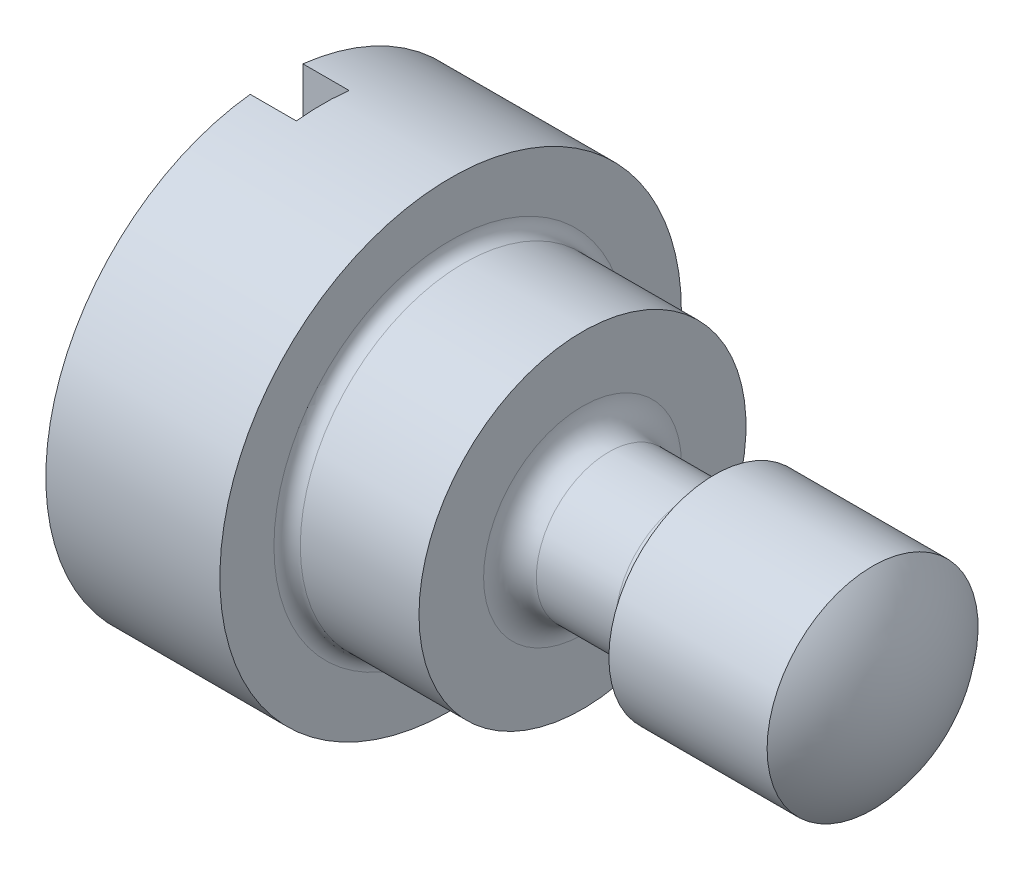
ISO-10303-21;
HEADER;
FILE_DESCRIPTION(('STEP AP214'),'2;1');
FILE_NAME('part.step','',(''),(''),'','','');
FILE_SCHEMA(('AUTOMOTIVE_DESIGN { 1 0 10303 214 1 1 1 1 }'));
ENDSEC;
DATA;
#1=APPLICATION_CONTEXT('core data for automotive mechanical design processes');
#2=APPLICATION_PROTOCOL_DEFINITION('international standard','automotive_design',2000,#1);
#3=PRODUCT_CONTEXT('',#1,'mechanical');
#4=PRODUCT('Part','Part','',(#3));
#5=PRODUCT_RELATED_PRODUCT_CATEGORY('part','',(#4));
#6=PRODUCT_DEFINITION_FORMATION('','',#4);
#7=PRODUCT_DEFINITION_CONTEXT('part definition',#1,'design');
#8=PRODUCT_DEFINITION('design','',#6,#7);
#9=PRODUCT_DEFINITION_SHAPE('','',#8);
#10=(LENGTH_UNIT() NAMED_UNIT(*) SI_UNIT(.MILLI.,.METRE.));
#11=(NAMED_UNIT(*) PLANE_ANGLE_UNIT() SI_UNIT($,.RADIAN.));
#12=(NAMED_UNIT(*) SI_UNIT($,.STERADIAN.) SOLID_ANGLE_UNIT());
#13=UNCERTAINTY_MEASURE_WITH_UNIT(LENGTH_MEASURE(1.E-05),#10,'distance_accuracy_value','');
#14=(GEOMETRIC_REPRESENTATION_CONTEXT(3) GLOBAL_UNCERTAINTY_ASSIGNED_CONTEXT((#13)) GLOBAL_UNIT_ASSIGNED_CONTEXT((#10,
#11,#12)) REPRESENTATION_CONTEXT('',''));
#15=CARTESIAN_POINT('',(0.,0.,0.));
#16=DIRECTION('',(0.,0.,1.));
#17=DIRECTION('',(1.,0.,0.));
#18=AXIS2_PLACEMENT_3D('',#15,#16,#17);
#19=CARTESIAN_POINT('',(1.32,0.,0.));
#20=DIRECTION('',(1.,0.,0.));
#21=DIRECTION('',(0.,0.,-1.));
#22=AXIS2_PLACEMENT_3D('',#19,#20,#21);
#23=PLANE('',#22);
#24=CARTESIAN_POINT('',(1.32,0.,0.));
#25=DIRECTION('',(1.,0.,0.));
#26=DIRECTION('',(0.,0.,-1.));
#27=AXIS2_PLACEMENT_3D('',#24,#25,#26);
#28=CIRCLE('',#27,1.34);
#29=CARTESIAN_POINT('',(1.32,0.,-1.34));
#30=VERTEX_POINT('',#29);
#31=EDGE_CURVE('E54',#30,#30,#28,.F.);
#32=ORIENTED_EDGE('',*,*,#31,.T.);
#33=EDGE_LOOP('',(#32));
#34=FACE_BOUND('',#33,.T.);
#35=CARTESIAN_POINT('',(1.32,0.,0.));
#36=DIRECTION('',(1.,0.,0.));
#37=DIRECTION('',(0.,0.,-1.));
#38=AXIS2_PLACEMENT_3D('',#35,#36,#37);
#39=CIRCLE('',#38,1.75);
#40=CARTESIAN_POINT('',(1.32,0.,-1.75));
#41=VERTEX_POINT('',#40);
#42=EDGE_CURVE('E116',#41,#41,#39,.T.);
#43=ORIENTED_EDGE('',*,*,#42,.T.);
#44=EDGE_LOOP('',(#43));
#45=FACE_BOUND('',#44,.T.);
#46=ADVANCED_FACE('F50',(#34,#45),#23,.T.);
#47=CARTESIAN_POINT('',(0.,0.,0.));
#48=DIRECTION('',(1.,0.,0.));
#49=DIRECTION('',(0.,0.,-1.));
#50=AXIS2_PLACEMENT_3D('',#47,#48,#49);
#51=PLANE('',#50);
#52=CARTESIAN_POINT('',(0.,0.,0.));
#53=DIRECTION('',(1.,0.,0.));
#54=DIRECTION('',(0.,0.,-1.));
#55=AXIS2_PLACEMENT_3D('',#52,#53,#54);
#56=CIRCLE('',#55,1.75);
#57=CARTESIAN_POINT('',(0.,-1.73853386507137,-0.2));
#58=VERTEX_POINT('',#57);
#59=CARTESIAN_POINT('',(0.,1.73853386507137,-0.2));
#60=VERTEX_POINT('',#59);
#61=EDGE_CURVE('E114',#58,#60,#56,.T.);
#62=ORIENTED_EDGE('',*,*,#61,.F.);
#63=DIRECTION('',(0.,1.,0.));
#64=VECTOR('',#63,1.);
#65=CARTESIAN_POINT('',(0.,0.,-0.2));
#66=LINE('',#65,#64);
#67=EDGE_CURVE('E125',#58,#60,#66,.T.);
#68=ORIENTED_EDGE('',*,*,#67,.T.);
#69=EDGE_LOOP('',(#62,#68));
#70=FACE_BOUND('',#69,.T.);
#71=ADVANCED_FACE('F142',(#70),#51,.F.);
#72=CARTESIAN_POINT('',(1.32,0.,0.));
#73=DIRECTION('',(-1.,0.,0.));
#74=DIRECTION('',(0.,0.,1.));
#75=AXIS2_PLACEMENT_3D('',#72,#73,#74);
#76=CYLINDRICAL_SURFACE('',#75,1.75);
#77=ORIENTED_EDGE('',*,*,#42,.F.);
#78=EDGE_LOOP('',(#77));
#79=FACE_BOUND('',#78,.T.);
#80=ORIENTED_EDGE('',*,*,#61,.T.);
#81=DIRECTION('',(-1.,0.,0.));
#82=VECTOR('',#81,1.);
#83=CARTESIAN_POINT('',(1.32,1.73853386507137,-0.2));
#84=LINE('',#83,#82);
#85=CARTESIAN_POINT('',(0.35,1.73853386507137,-0.2));
#86=VERTEX_POINT('',#85);
#87=EDGE_CURVE('E110',#60,#86,#84,.F.);
#88=ORIENTED_EDGE('',*,*,#87,.T.);
#89=CARTESIAN_POINT('',(0.35,0.,0.));
#90=DIRECTION('',(1.,0.,0.));
#91=DIRECTION('',(0.,0.,-1.));
#92=AXIS2_PLACEMENT_3D('',#89,#90,#91);
#93=CIRCLE('',#92,1.75);
#94=CARTESIAN_POINT('',(0.35,1.73853386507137,0.2));
#95=VERTEX_POINT('',#94);
#96=EDGE_CURVE('E67',#86,#95,#93,.T.);
#97=ORIENTED_EDGE('',*,*,#96,.T.);
#98=DIRECTION('',(-1.,0.,0.));
#99=VECTOR('',#98,1.);
#100=CARTESIAN_POINT('',(1.32,1.73853386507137,0.2));
#101=LINE('',#100,#99);
#102=CARTESIAN_POINT('',(0.,1.73853386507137,0.2));
#103=VERTEX_POINT('',#102);
#104=EDGE_CURVE('E96',#95,#103,#101,.T.);
#105=ORIENTED_EDGE('',*,*,#104,.T.);
#106=CARTESIAN_POINT('',(0.,-1.73853386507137,0.2));
#107=VERTEX_POINT('',#106);
#108=EDGE_CURVE('E102',#103,#107,#56,.T.);
#109=ORIENTED_EDGE('',*,*,#108,.T.);
#110=DIRECTION('',(-1.,0.,0.));
#111=VECTOR('',#110,1.);
#112=CARTESIAN_POINT('',(1.32,-1.73853386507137,0.2));
#113=LINE('',#112,#111);
#114=CARTESIAN_POINT('',(0.35,-1.73853386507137,0.2));
#115=VERTEX_POINT('',#114);
#116=EDGE_CURVE('E65',#107,#115,#113,.F.);
#117=ORIENTED_EDGE('',*,*,#116,.T.);
#118=CARTESIAN_POINT('',(0.35,-1.73853386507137,-0.2));
#119=VERTEX_POINT('',#118);
#120=EDGE_CURVE('E88',#115,#119,#93,.T.);
#121=ORIENTED_EDGE('',*,*,#120,.T.);
#122=DIRECTION('',(-1.,0.,0.));
#123=VECTOR('',#122,1.);
#124=CARTESIAN_POINT('',(1.32,-1.73853386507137,-0.2));
#125=LINE('',#124,#123);
#126=EDGE_CURVE('E113',#119,#58,#125,.T.);
#127=ORIENTED_EDGE('',*,*,#126,.T.);
#128=EDGE_LOOP('',(#80,#88,#97,#105,#109,#117,#121,#127));
#129=FACE_BOUND('',#128,.T.);
#130=ADVANCED_FACE('F101',(#79,#129),#76,.T.);
#131=ORIENTED_EDGE('',*,*,#108,.F.);
#132=DIRECTION('',(0.,-1.,0.));
#133=VECTOR('',#132,1.);
#134=CARTESIAN_POINT('',(0.,0.,0.2));
#135=LINE('',#134,#133);
#136=EDGE_CURVE('E118',#103,#107,#135,.T.);
#137=ORIENTED_EDGE('',*,*,#136,.T.);
#138=EDGE_LOOP('',(#131,#137));
#139=FACE_BOUND('',#138,.T.);
#140=ADVANCED_FACE('F146',(#139),#51,.F.);
#141=CARTESIAN_POINT('',(0.35,-1.75,-0.2));
#142=DIRECTION('',(1.,0.,0.));
#143=DIRECTION('',(0.,0.,-1.));
#144=AXIS2_PLACEMENT_3D('',#141,#142,#143);
#145=PLANE('',#144);
#146=DIRECTION('',(0.,1.,0.));
#147=VECTOR('',#146,1.);
#148=CARTESIAN_POINT('',(0.35,-1.75,-0.2));
#149=LINE('',#148,#147);
#150=EDGE_CURVE('E95',#119,#86,#149,.T.);
#151=ORIENTED_EDGE('',*,*,#150,.F.);
#152=ORIENTED_EDGE('',*,*,#120,.F.);
#153=DIRECTION('',(0.,1.,0.));
#154=VECTOR('',#153,1.);
#155=CARTESIAN_POINT('',(0.35,-1.75,0.2));
#156=LINE('',#155,#154);
#157=EDGE_CURVE('E93',#115,#95,#156,.T.);
#158=ORIENTED_EDGE('',*,*,#157,.T.);
#159=ORIENTED_EDGE('',*,*,#96,.F.);
#160=EDGE_LOOP('',(#151,#152,#158,#159));
#161=FACE_BOUND('',#160,.T.);
#162=ADVANCED_FACE('F87',(#161),#145,.F.);
#163=CARTESIAN_POINT('',(0.,-1.75,-0.2));
#164=DIRECTION('',(0.,0.,-1.));
#165=DIRECTION('',(-1.,0.,0.));
#166=AXIS2_PLACEMENT_3D('',#163,#164,#165);
#167=PLANE('',#166);
#168=ORIENTED_EDGE('',*,*,#150,.T.);
#169=ORIENTED_EDGE('',*,*,#87,.F.);
#170=ORIENTED_EDGE('',*,*,#67,.F.);
#171=ORIENTED_EDGE('',*,*,#126,.F.);
#172=EDGE_LOOP('',(#168,#169,#170,#171));
#173=FACE_BOUND('',#172,.T.);
#174=ADVANCED_FACE('F147',(#173),#167,.F.);
#175=CARTESIAN_POINT('',(0.,-1.75,0.2));
#176=DIRECTION('',(0.,0.,1.));
#177=DIRECTION('',(1.,0.,0.));
#178=AXIS2_PLACEMENT_3D('',#175,#176,#177);
#179=PLANE('',#178);
#180=ORIENTED_EDGE('',*,*,#157,.F.);
#181=ORIENTED_EDGE('',*,*,#116,.F.);
#182=ORIENTED_EDGE('',*,*,#136,.F.);
#183=ORIENTED_EDGE('',*,*,#104,.F.);
#184=EDGE_LOOP('',(#180,#181,#182,#183));
#185=FACE_BOUND('',#184,.T.);
#186=ADVANCED_FACE('F98',(#185),#179,.F.);
#187=CARTESIAN_POINT('',(3.60333333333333,0.,0.));
#188=DIRECTION('',(-1.,0.,0.));
#189=DIRECTION('',(0.,1.,0.));
#190=AXIS2_PLACEMENT_3D('',#187,#188,#189);
#191=SPHERICAL_SURFACE('',#190,1.21666666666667);
#192=CARTESIAN_POINT('',(4.52,0.,0.));
#193=DIRECTION('',(-1.,0.,0.));
#194=DIRECTION('',(0.,0.,1.));
#195=AXIS2_PLACEMENT_3D('',#192,#193,#194);
#196=CIRCLE('',#195,0.8);
#197=CARTESIAN_POINT('',(4.52,0.,0.8));
#198=VERTEX_POINT('',#197);
#199=EDGE_CURVE('E298',#198,#198,#196,.T.);
#200=ORIENTED_EDGE('',*,*,#199,.F.);
#201=EDGE_LOOP('',(#200));
#202=FACE_BOUND('',#201,.T.);
#203=ADVANCED_FACE('F189',(#202),#191,.T.);
#204=CARTESIAN_POINT('',(-0.659514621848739,0.,0.));
#205=DIRECTION('',(-1.,0.,0.));
#206=DIRECTION('',(0.,0.,1.));
#207=AXIS2_PLACEMENT_3D('',#204,#205,#206);
#208=CYLINDRICAL_SURFACE('',#207,1.24);
#209=CARTESIAN_POINT('',(1.42,0.,0.));
#210=DIRECTION('',(1.,0.,0.));
#211=DIRECTION('',(0.,0.,-1.));
#212=AXIS2_PLACEMENT_3D('',#209,#210,#211);
#213=CIRCLE('',#212,1.24);
#214=CARTESIAN_POINT('',(1.42,0.,-1.24));
#215=VERTEX_POINT('',#214);
#216=EDGE_CURVE('E11',#215,#215,#213,.T.);
#217=ORIENTED_EDGE('',*,*,#216,.T.);
#218=EDGE_LOOP('',(#217));
#219=FACE_BOUND('',#218,.T.);
#220=CARTESIAN_POINT('',(2.32,0.,0.));
#221=DIRECTION('',(-1.,0.,0.));
#222=DIRECTION('',(0.,0.,1.));
#223=AXIS2_PLACEMENT_3D('',#220,#221,#222);
#224=CIRCLE('',#223,1.24);
#225=CARTESIAN_POINT('',(2.32,0.,1.24));
#226=VERTEX_POINT('',#225);
#227=EDGE_CURVE('E100',#226,#226,#224,.T.);
#228=ORIENTED_EDGE('',*,*,#227,.T.);
#229=EDGE_LOOP('',(#228));
#230=FACE_BOUND('',#229,.T.);
#231=ADVANCED_FACE('F199',(#219,#230),#208,.T.);
#232=CARTESIAN_POINT('',(2.32,1.24,0.));
#233=DIRECTION('',(-1.,0.,0.));
#234=DIRECTION('',(0.,0.,1.));
#235=AXIS2_PLACEMENT_3D('',#232,#233,#234);
#236=PLANE('',#235);
#237=ORIENTED_EDGE('',*,*,#227,.F.);
#238=EDGE_LOOP('',(#237));
#239=FACE_BOUND('',#238,.T.);
#240=CARTESIAN_POINT('',(2.32,0.,0.));
#241=DIRECTION('',(-1.,0.,0.));
#242=DIRECTION('',(0.,0.,1.));
#243=AXIS2_PLACEMENT_3D('',#240,#241,#242);
#244=CIRCLE('',#243,0.75);
#245=CARTESIAN_POINT('',(2.32,0.,0.75));
#246=VERTEX_POINT('',#245);
#247=EDGE_CURVE('E279',#246,#246,#244,.T.);
#248=ORIENTED_EDGE('',*,*,#247,.T.);
#249=EDGE_LOOP('',(#248));
#250=FACE_BOUND('',#249,.T.);
#251=ADVANCED_FACE('F201',(#239,#250),#236,.F.);
#252=CARTESIAN_POINT('',(2.52,0.,0.));
#253=DIRECTION('',(-1.,0.,0.));
#254=DIRECTION('',(0.,0.,1.));
#255=AXIS2_PLACEMENT_3D('',#252,#253,#254);
#256=TOROIDAL_SURFACE('',#255,0.75,0.2);
#257=ORIENTED_EDGE('',*,*,#247,.F.);
#258=EDGE_LOOP('',(#257));
#259=FACE_BOUND('',#258,.T.);
#260=CARTESIAN_POINT('',(2.52,0.,0.));
#261=DIRECTION('',(-1.,0.,0.));
#262=DIRECTION('',(0.,0.,1.));
#263=AXIS2_PLACEMENT_3D('',#260,#261,#262);
#264=CIRCLE('',#263,0.55);
#265=CARTESIAN_POINT('',(2.52,0.,0.55));
#266=VERTEX_POINT('',#265);
#267=EDGE_CURVE('E281',#266,#266,#264,.T.);
#268=ORIENTED_EDGE('',*,*,#267,.T.);
#269=EDGE_LOOP('',(#268));
#270=FACE_BOUND('',#269,.T.);
#271=ADVANCED_FACE('F210',(#259,#270),#256,.F.);
#272=CARTESIAN_POINT('',(-0.659514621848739,0.,0.));
#273=DIRECTION('',(-1.,0.,0.));
#274=DIRECTION('',(0.,0.,1.));
#275=AXIS2_PLACEMENT_3D('',#272,#273,#274);
#276=CYLINDRICAL_SURFACE('',#275,0.55);
#277=ORIENTED_EDGE('',*,*,#267,.F.);
#278=EDGE_LOOP('',(#277));
#279=FACE_BOUND('',#278,.T.);
#280=CARTESIAN_POINT('',(3.12,0.,0.));
#281=DIRECTION('',(-1.,0.,0.));
#282=DIRECTION('',(0.,0.,1.));
#283=AXIS2_PLACEMENT_3D('',#280,#281,#282);
#284=CIRCLE('',#283,0.55);
#285=CARTESIAN_POINT('',(3.12,0.,0.55));
#286=VERTEX_POINT('',#285);
#287=EDGE_CURVE('E290',#286,#286,#284,.T.);
#288=ORIENTED_EDGE('',*,*,#287,.T.);
#289=EDGE_LOOP('',(#288));
#290=FACE_BOUND('',#289,.T.);
#291=ADVANCED_FACE('F219',(#279,#290),#276,.T.);
#292=CARTESIAN_POINT('',(3.12,0.,0.));
#293=DIRECTION('',(-1.,0.,0.));
#294=DIRECTION('',(0.,0.,1.));
#295=AXIS2_PLACEMENT_3D('',#292,#293,#294);
#296=TOROIDAL_SURFACE('',#295,0.75,0.2);
#297=ORIENTED_EDGE('',*,*,#287,.F.);
#298=EDGE_LOOP('',(#297));
#299=FACE_BOUND('',#298,.T.);
#300=CARTESIAN_POINT('',(3.32,0.,0.));
#301=DIRECTION('',(-1.,0.,0.));
#302=DIRECTION('',(0.,0.,1.));
#303=AXIS2_PLACEMENT_3D('',#300,#301,#302);
#304=CIRCLE('',#303,0.75);
#305=CARTESIAN_POINT('',(3.32,0.,0.75));
#306=VERTEX_POINT('',#305);
#307=EDGE_CURVE('E287',#306,#306,#304,.T.);
#308=ORIENTED_EDGE('',*,*,#307,.T.);
#309=EDGE_LOOP('',(#308));
#310=FACE_BOUND('',#309,.T.);
#311=ADVANCED_FACE('F222',(#299,#310),#296,.F.);
#312=CARTESIAN_POINT('',(3.32,0.75,0.));
#313=DIRECTION('',(1.,0.,0.));
#314=DIRECTION('',(0.,0.,-1.));
#315=AXIS2_PLACEMENT_3D('',#312,#313,#314);
#316=PLANE('',#315);
#317=ORIENTED_EDGE('',*,*,#307,.F.);
#318=EDGE_LOOP('',(#317));
#319=FACE_BOUND('',#318,.T.);
#320=CARTESIAN_POINT('',(3.32,0.,0.));
#321=DIRECTION('',(-1.,0.,0.));
#322=DIRECTION('',(0.,0.,1.));
#323=AXIS2_PLACEMENT_3D('',#320,#321,#322);
#324=CIRCLE('',#323,0.8);
#325=CARTESIAN_POINT('',(3.32,0.,0.8));
#326=VERTEX_POINT('',#325);
#327=EDGE_CURVE('E291',#326,#326,#324,.T.);
#328=ORIENTED_EDGE('',*,*,#327,.T.);
#329=EDGE_LOOP('',(#328));
#330=FACE_BOUND('',#329,.T.);
#331=ADVANCED_FACE('F138',(#319,#330),#316,.F.);
#332=CARTESIAN_POINT('',(-0.659514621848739,0.,0.));
#333=DIRECTION('',(-1.,0.,0.));
#334=DIRECTION('',(0.,0.,1.));
#335=AXIS2_PLACEMENT_3D('',#332,#333,#334);
#336=CYLINDRICAL_SURFACE('',#335,0.8);
#337=ORIENTED_EDGE('',*,*,#327,.F.);
#338=EDGE_LOOP('',(#337));
#339=FACE_BOUND('',#338,.T.);
#340=ORIENTED_EDGE('',*,*,#199,.T.);
#341=EDGE_LOOP('',(#340));
#342=FACE_BOUND('',#341,.T.);
#343=ADVANCED_FACE('F127',(#339,#342),#336,.T.);
#344=CARTESIAN_POINT('',(1.42,0.,0.));
#345=DIRECTION('',(1.,0.,0.));
#346=DIRECTION('',(0.,0.,-1.));
#347=AXIS2_PLACEMENT_3D('',#344,#345,#346);
#348=TOROIDAL_SURFACE('',#347,1.34,0.1);
#349=ORIENTED_EDGE('',*,*,#216,.F.);
#350=EDGE_LOOP('',(#349));
#351=FACE_BOUND('',#350,.T.);
#352=ORIENTED_EDGE('',*,*,#31,.F.);
#353=EDGE_LOOP('',(#352));
#354=FACE_BOUND('',#353,.T.);
#355=ADVANCED_FACE('F47',(#351,#354),#348,.F.);
#356=CLOSED_SHELL('',(#46,#71,#130,#140,#162,#174,#186,#203,#231,#251,#271,#291,#311,#331,#343,#355));
#357=MANIFOLD_SOLID_BREP('B2',#356);
#358=ADVANCED_BREP_SHAPE_REPRESENTATION('',(#18,#357),#14);
#359=SHAPE_DEFINITION_REPRESENTATION(#9,#358);
ENDSEC;
END-ISO-10303-21;
